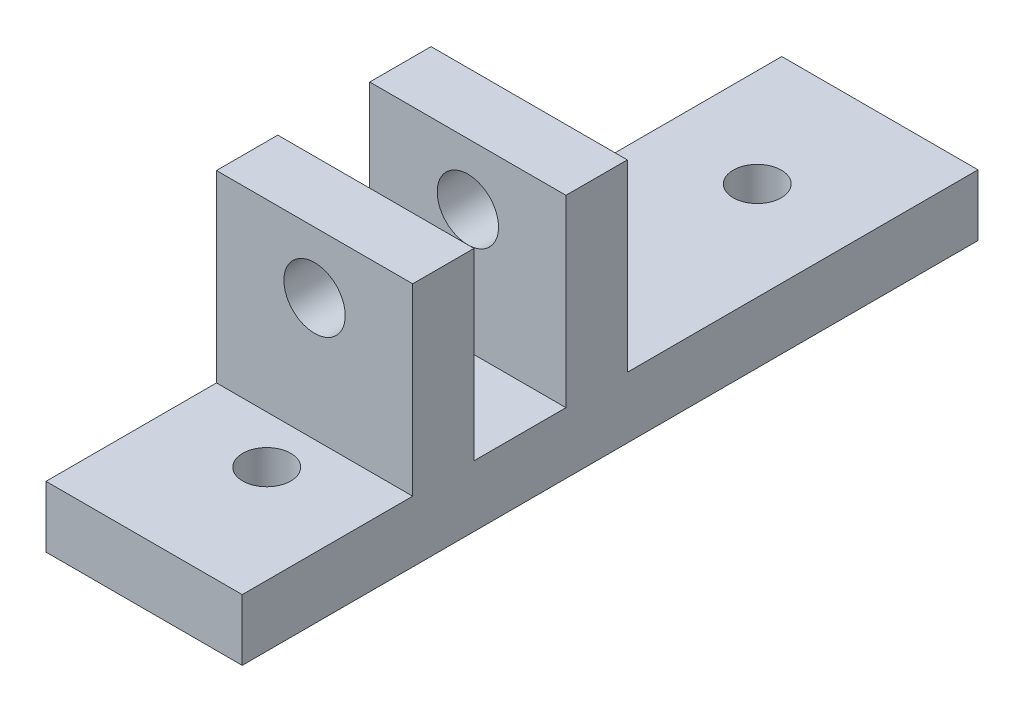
ISO-10303-21;
HEADER;
FILE_DESCRIPTION(('STEP AP214'),'2;1');
FILE_NAME('part.step','',(''),(''),'','','');
FILE_SCHEMA(('AUTOMOTIVE_DESIGN { 1 0 10303 214 1 1 1 1 }'));
ENDSEC;
DATA;
#1=APPLICATION_CONTEXT('core data for automotive mechanical design processes');
#2=APPLICATION_PROTOCOL_DEFINITION('international standard','automotive_design',2000,#1);
#3=PRODUCT_CONTEXT('',#1,'mechanical');
#4=PRODUCT('Part','Part','',(#3));
#5=PRODUCT_RELATED_PRODUCT_CATEGORY('part','',(#4));
#6=PRODUCT_DEFINITION_FORMATION('','',#4);
#7=PRODUCT_DEFINITION_CONTEXT('part definition',#1,'design');
#8=PRODUCT_DEFINITION('design','',#6,#7);
#9=PRODUCT_DEFINITION_SHAPE('','',#8);
#10=(LENGTH_UNIT() NAMED_UNIT(*) SI_UNIT(.MILLI.,.METRE.));
#11=(NAMED_UNIT(*) PLANE_ANGLE_UNIT() SI_UNIT($,.RADIAN.));
#12=(NAMED_UNIT(*) SI_UNIT($,.STERADIAN.) SOLID_ANGLE_UNIT());
#13=UNCERTAINTY_MEASURE_WITH_UNIT(LENGTH_MEASURE(1.E-05),#10,'distance_accuracy_value','');
#14=(GEOMETRIC_REPRESENTATION_CONTEXT(3) GLOBAL_UNCERTAINTY_ASSIGNED_CONTEXT((#13)) GLOBAL_UNIT_ASSIGNED_CONTEXT((#10,
#11,#12)) REPRESENTATION_CONTEXT('',''));
#15=CARTESIAN_POINT('',(0.,0.,0.));
#16=DIRECTION('',(0.,0.,1.));
#17=DIRECTION('',(1.,0.,0.));
#18=AXIS2_PLACEMENT_3D('',#15,#16,#17);
#19=CARTESIAN_POINT('',(0.,0.,76.2));
#20=DIRECTION('',(0.,0.,-1.));
#21=DIRECTION('',(-1.,0.,0.));
#22=AXIS2_PLACEMENT_3D('',#19,#20,#21);
#23=PLANE('',#22);
#24=DIRECTION('',(1.,0.,0.));
#25=VECTOR('',#24,1.);
#26=CARTESIAN_POINT('',(0.,6.35,76.2));
#27=LINE('',#26,#25);
#28=CARTESIAN_POINT('',(0.,6.35,76.2));
#29=VERTEX_POINT('',#28);
#30=CARTESIAN_POINT('',(20.32,6.35,76.2));
#31=VERTEX_POINT('',#30);
#32=EDGE_CURVE('E124',#29,#31,#27,.T.);
#33=ORIENTED_EDGE('',*,*,#32,.F.);
#34=DIRECTION('',(0.,-1.,0.));
#35=VECTOR('',#34,1.);
#36=CARTESIAN_POINT('',(0.,0.,76.2));
#37=LINE('',#36,#35);
#38=CARTESIAN_POINT('',(0.,0.,76.2));
#39=VERTEX_POINT('',#38);
#40=EDGE_CURVE('E149',#29,#39,#37,.T.);
#41=ORIENTED_EDGE('',*,*,#40,.T.);
#42=DIRECTION('',(1.,0.,0.));
#43=VECTOR('',#42,1.);
#44=CARTESIAN_POINT('',(0.,0.,76.2));
#45=LINE('',#44,#43);
#46=CARTESIAN_POINT('',(20.32,0.,76.2));
#47=VERTEX_POINT('',#46);
#48=EDGE_CURVE('E144',#39,#47,#45,.T.);
#49=ORIENTED_EDGE('',*,*,#48,.T.);
#50=DIRECTION('',(0.,1.,0.));
#51=VECTOR('',#50,1.);
#52=CARTESIAN_POINT('',(20.32,0.,76.2));
#53=LINE('',#52,#51);
#54=EDGE_CURVE('E139',#47,#31,#53,.T.);
#55=ORIENTED_EDGE('',*,*,#54,.T.);
#56=EDGE_LOOP('',(#33,#41,#49,#55));
#57=FACE_BOUND('',#56,.T.);
#58=ADVANCED_FACE('F33',(#57),#23,.F.);
#59=CARTESIAN_POINT('',(0.,25.4,76.2));
#60=DIRECTION('',(0.,-1.,0.));
#61=DIRECTION('',(0.,0.,-1.));
#62=AXIS2_PLACEMENT_3D('',#59,#60,#61);
#63=PLANE('',#62);
#64=DIRECTION('',(0.,0.,-1.));
#65=VECTOR('',#64,1.);
#66=CARTESIAN_POINT('',(0.,25.4,76.2));
#67=LINE('',#66,#65);
#68=CARTESIAN_POINT('',(0.,25.4,42.672));
#69=VERTEX_POINT('',#68);
#70=CARTESIAN_POINT('',(0.,25.4,36.322));
#71=VERTEX_POINT('',#70);
#72=EDGE_CURVE('E146',#69,#71,#67,.T.);
#73=ORIENTED_EDGE('',*,*,#72,.F.);
#74=DIRECTION('',(-1.,0.,0.));
#75=VECTOR('',#74,1.);
#76=CARTESIAN_POINT('',(0.,25.4,42.672));
#77=LINE('',#76,#75);
#78=CARTESIAN_POINT('',(20.32,25.4,42.672));
#79=VERTEX_POINT('',#78);
#80=EDGE_CURVE('E204',#79,#69,#77,.T.);
#81=ORIENTED_EDGE('',*,*,#80,.F.);
#82=DIRECTION('',(0.,0.,-1.));
#83=VECTOR('',#82,1.);
#84=CARTESIAN_POINT('',(20.32,25.4,76.2));
#85=LINE('',#84,#83);
#86=CARTESIAN_POINT('',(20.32,25.4,36.322));
#87=VERTEX_POINT('',#86);
#88=EDGE_CURVE('E161',#79,#87,#85,.T.);
#89=ORIENTED_EDGE('',*,*,#88,.T.);
#90=DIRECTION('',(1.,0.,0.));
#91=VECTOR('',#90,1.);
#92=CARTESIAN_POINT('',(0.,25.4,36.322));
#93=LINE('',#92,#91);
#94=EDGE_CURVE('E219',#71,#87,#93,.T.);
#95=ORIENTED_EDGE('',*,*,#94,.F.);
#96=EDGE_LOOP('',(#73,#81,#89,#95));
#97=FACE_BOUND('',#96,.T.);
#98=ADVANCED_FACE('F261',(#97),#63,.F.);
#99=CARTESIAN_POINT('',(0.,0.,0.));
#100=DIRECTION('',(0.,0.,-1.));
#101=DIRECTION('',(-1.,0.,0.));
#102=AXIS2_PLACEMENT_3D('',#99,#100,#101);
#103=PLANE('',#102);
#104=DIRECTION('',(0.,-1.,0.));
#105=VECTOR('',#104,1.);
#106=CARTESIAN_POINT('',(0.,0.,0.));
#107=LINE('',#106,#105);
#108=CARTESIAN_POINT('',(0.,6.35,0.));
#109=VERTEX_POINT('',#108);
#110=CARTESIAN_POINT('',(0.,0.,0.));
#111=VERTEX_POINT('',#110);
#112=EDGE_CURVE('E153',#109,#111,#107,.T.);
#113=ORIENTED_EDGE('',*,*,#112,.F.);
#114=DIRECTION('',(1.,0.,0.));
#115=VECTOR('',#114,1.);
#116=CARTESIAN_POINT('',(0.,6.35,0.));
#117=LINE('',#116,#115);
#118=CARTESIAN_POINT('',(20.32,6.35,0.));
#119=VERTEX_POINT('',#118);
#120=EDGE_CURVE('E11',#109,#119,#117,.T.);
#121=ORIENTED_EDGE('',*,*,#120,.T.);
#122=DIRECTION('',(0.,1.,0.));
#123=VECTOR('',#122,1.);
#124=CARTESIAN_POINT('',(20.32,0.,0.));
#125=LINE('',#124,#123);
#126=CARTESIAN_POINT('',(20.32,0.,0.));
#127=VERTEX_POINT('',#126);
#128=EDGE_CURVE('E158',#127,#119,#125,.T.);
#129=ORIENTED_EDGE('',*,*,#128,.F.);
#130=DIRECTION('',(1.,0.,0.));
#131=VECTOR('',#130,1.);
#132=CARTESIAN_POINT('',(0.,0.,0.));
#133=LINE('',#132,#131);
#134=EDGE_CURVE('E155',#111,#127,#133,.T.);
#135=ORIENTED_EDGE('',*,*,#134,.F.);
#136=EDGE_LOOP('',(#113,#121,#129,#135));
#137=FACE_BOUND('',#136,.T.);
#138=ADVANCED_FACE('F248',(#137),#103,.T.);
#139=CARTESIAN_POINT('',(0.,0.,76.2));
#140=DIRECTION('',(1.,0.,0.));
#141=DIRECTION('',(0.,0.,-1.));
#142=AXIS2_PLACEMENT_3D('',#139,#140,#141);
#143=PLANE('',#142);
#144=DIRECTION('',(0.,0.,1.));
#145=VECTOR('',#144,1.);
#146=CARTESIAN_POINT('',(0.,6.35,58.547));
#147=LINE('',#146,#145);
#148=CARTESIAN_POINT('',(0.,6.35,58.547));
#149=VERTEX_POINT('',#148);
#150=EDGE_CURVE('E50',#149,#29,#147,.T.);
#151=ORIENTED_EDGE('',*,*,#150,.F.);
#152=DIRECTION('',(0.,1.,0.));
#153=VECTOR('',#152,1.);
#154=CARTESIAN_POINT('',(0.,6.35,58.547));
#155=LINE('',#154,#153);
#156=CARTESIAN_POINT('',(0.,25.4,58.547));
#157=VERTEX_POINT('',#156);
#158=EDGE_CURVE('E196',#149,#157,#155,.T.);
#159=ORIENTED_EDGE('',*,*,#158,.T.);
#160=CARTESIAN_POINT('',(0.,25.4,52.197));
#161=VERTEX_POINT('',#160);
#162=EDGE_CURVE('E58',#157,#161,#67,.T.);
#163=ORIENTED_EDGE('',*,*,#162,.T.);
#164=DIRECTION('',(0.,1.,0.));
#165=VECTOR('',#164,1.);
#166=CARTESIAN_POINT('',(0.,6.35,52.197));
#167=LINE('',#166,#165);
#168=CARTESIAN_POINT('',(0.,6.35,52.197));
#169=VERTEX_POINT('',#168);
#170=EDGE_CURVE('E212',#169,#161,#167,.T.);
#171=ORIENTED_EDGE('',*,*,#170,.F.);
#172=DIRECTION('',(0.,0.,1.));
#173=VECTOR('',#172,1.);
#174=CARTESIAN_POINT('',(0.,6.35,42.672));
#175=LINE('',#174,#173);
#176=CARTESIAN_POINT('',(0.,6.35,42.672));
#177=VERTEX_POINT('',#176);
#178=EDGE_CURVE('E200',#177,#169,#175,.T.);
#179=ORIENTED_EDGE('',*,*,#178,.F.);
#180=DIRECTION('',(0.,1.,0.));
#181=VECTOR('',#180,1.);
#182=CARTESIAN_POINT('',(0.,6.35,42.672));
#183=LINE('',#182,#181);
#184=EDGE_CURVE('E216',#177,#69,#183,.T.);
#185=ORIENTED_EDGE('',*,*,#184,.T.);
#186=ORIENTED_EDGE('',*,*,#72,.T.);
#187=DIRECTION('',(0.,1.,0.));
#188=VECTOR('',#187,1.);
#189=CARTESIAN_POINT('',(0.,6.35,36.322));
#190=LINE('',#189,#188);
#191=CARTESIAN_POINT('',(0.,6.35,36.322));
#192=VERTEX_POINT('',#191);
#193=EDGE_CURVE('E233',#192,#71,#190,.T.);
#194=ORIENTED_EDGE('',*,*,#193,.F.);
#195=DIRECTION('',(0.,0.,1.));
#196=VECTOR('',#195,1.);
#197=CARTESIAN_POINT('',(0.,6.35,-50.8));
#198=LINE('',#197,#196);
#199=EDGE_CURVE('E226',#109,#192,#198,.T.);
#200=ORIENTED_EDGE('',*,*,#199,.F.);
#201=ORIENTED_EDGE('',*,*,#112,.T.);
#202=DIRECTION('',(0.,0.,-1.));
#203=VECTOR('',#202,1.);
#204=CARTESIAN_POINT('',(0.,0.,76.2));
#205=LINE('',#204,#203);
#206=EDGE_CURVE('E42',#39,#111,#205,.T.);
#207=ORIENTED_EDGE('',*,*,#206,.F.);
#208=ORIENTED_EDGE('',*,*,#40,.F.);
#209=EDGE_LOOP('',(#151,#159,#163,#171,#179,#185,#186,#194,#200,#201,#207,#208));
#210=FACE_BOUND('',#209,.T.);
#211=ADVANCED_FACE('F35',(#210),#143,.F.);
#212=CARTESIAN_POINT('',(0.,0.,76.2));
#213=DIRECTION('',(0.,1.,0.));
#214=DIRECTION('',(0.,0.,1.));
#215=AXIS2_PLACEMENT_3D('',#212,#213,#214);
#216=PLANE('',#215);
#217=CARTESIAN_POINT('',(10.16,0.,12.7));
#218=DIRECTION('',(0.,-1.,0.));
#219=DIRECTION('',(0.,0.,-1.));
#220=AXIS2_PLACEMENT_3D('',#217,#218,#219);
#221=CIRCLE('',#220,2.4892);
#222=CARTESIAN_POINT('',(10.16,0.,10.2108));
#223=VERTEX_POINT('',#222);
#224=EDGE_CURVE('E181',#223,#223,#221,.T.);
#225=ORIENTED_EDGE('',*,*,#224,.F.);
#226=EDGE_LOOP('',(#225));
#227=FACE_BOUND('',#226,.T.);
#228=CARTESIAN_POINT('',(10.16,0.,63.5));
#229=DIRECTION('',(0.,-1.,0.));
#230=DIRECTION('',(0.,0.,-1.));
#231=AXIS2_PLACEMENT_3D('',#228,#229,#230);
#232=CIRCLE('',#231,2.4892);
#233=CARTESIAN_POINT('',(10.16,0.,61.0108));
#234=VERTEX_POINT('',#233);
#235=EDGE_CURVE('E170',#234,#234,#232,.T.);
#236=ORIENTED_EDGE('',*,*,#235,.F.);
#237=EDGE_LOOP('',(#236));
#238=FACE_BOUND('',#237,.T.);
#239=ORIENTED_EDGE('',*,*,#134,.T.);
#240=DIRECTION('',(0.,0.,-1.));
#241=VECTOR('',#240,1.);
#242=CARTESIAN_POINT('',(20.32,0.,76.2));
#243=LINE('',#242,#241);
#244=EDGE_CURVE('E164',#47,#127,#243,.T.);
#245=ORIENTED_EDGE('',*,*,#244,.F.);
#246=ORIENTED_EDGE('',*,*,#48,.F.);
#247=ORIENTED_EDGE('',*,*,#206,.T.);
#248=EDGE_LOOP('',(#239,#245,#246,#247));
#249=FACE_BOUND('',#248,.T.);
#250=ADVANCED_FACE('F241',(#227,#238,#249),#216,.F.);
#251=CARTESIAN_POINT('',(20.32,0.,76.2));
#252=DIRECTION('',(-1.,0.,0.));
#253=DIRECTION('',(0.,0.,1.));
#254=AXIS2_PLACEMENT_3D('',#251,#252,#253);
#255=PLANE('',#254);
#256=CARTESIAN_POINT('',(20.32,25.4,58.547));
#257=VERTEX_POINT('',#256);
#258=CARTESIAN_POINT('',(20.32,25.4,52.197));
#259=VERTEX_POINT('',#258);
#260=EDGE_CURVE('E162',#257,#259,#85,.T.);
#261=ORIENTED_EDGE('',*,*,#260,.F.);
#262=DIRECTION('',(0.,1.,0.));
#263=VECTOR('',#262,1.);
#264=CARTESIAN_POINT('',(20.32,6.35,58.547));
#265=LINE('',#264,#263);
#266=CARTESIAN_POINT('',(20.32,6.35,58.547));
#267=VERTEX_POINT('',#266);
#268=EDGE_CURVE('E140',#267,#257,#265,.T.);
#269=ORIENTED_EDGE('',*,*,#268,.F.);
#270=DIRECTION('',(0.,0.,-1.));
#271=VECTOR('',#270,1.);
#272=CARTESIAN_POINT('',(20.32,6.35,58.547));
#273=LINE('',#272,#271);
#274=EDGE_CURVE('E127',#31,#267,#273,.T.);
#275=ORIENTED_EDGE('',*,*,#274,.F.);
#276=ORIENTED_EDGE('',*,*,#54,.F.);
#277=ORIENTED_EDGE('',*,*,#244,.T.);
#278=ORIENTED_EDGE('',*,*,#128,.T.);
#279=DIRECTION('',(0.,0.,-1.));
#280=VECTOR('',#279,1.);
#281=CARTESIAN_POINT('',(20.32,6.35,-50.8));
#282=LINE('',#281,#280);
#283=CARTESIAN_POINT('',(20.32,6.35,36.322));
#284=VERTEX_POINT('',#283);
#285=EDGE_CURVE('E231',#284,#119,#282,.T.);
#286=ORIENTED_EDGE('',*,*,#285,.F.);
#287=DIRECTION('',(0.,1.,0.));
#288=VECTOR('',#287,1.);
#289=CARTESIAN_POINT('',(20.32,6.35,36.322));
#290=LINE('',#289,#288);
#291=EDGE_CURVE('E156',#284,#87,#290,.T.);
#292=ORIENTED_EDGE('',*,*,#291,.T.);
#293=ORIENTED_EDGE('',*,*,#88,.F.);
#294=DIRECTION('',(0.,1.,0.));
#295=VECTOR('',#294,1.);
#296=CARTESIAN_POINT('',(20.32,6.35,42.672));
#297=LINE('',#296,#295);
#298=CARTESIAN_POINT('',(20.32,6.35,42.672));
#299=VERTEX_POINT('',#298);
#300=EDGE_CURVE('E220',#299,#79,#297,.T.);
#301=ORIENTED_EDGE('',*,*,#300,.F.);
#302=DIRECTION('',(0.,0.,-1.));
#303=VECTOR('',#302,1.);
#304=CARTESIAN_POINT('',(20.32,6.35,42.672));
#305=LINE('',#304,#303);
#306=CARTESIAN_POINT('',(20.32,6.35,52.197));
#307=VERTEX_POINT('',#306);
#308=EDGE_CURVE('E207',#307,#299,#305,.T.);
#309=ORIENTED_EDGE('',*,*,#308,.F.);
#310=DIRECTION('',(0.,1.,0.));
#311=VECTOR('',#310,1.);
#312=CARTESIAN_POINT('',(20.32,6.35,52.197));
#313=LINE('',#312,#311);
#314=EDGE_CURVE('E222',#307,#259,#313,.T.);
#315=ORIENTED_EDGE('',*,*,#314,.T.);
#316=EDGE_LOOP('',(#261,#269,#275,#276,#277,#278,#286,#292,#293,#301,#309,#315));
#317=FACE_BOUND('',#316,.T.);
#318=ADVANCED_FACE('F137',(#317),#255,.F.);
#319=ORIENTED_EDGE('',*,*,#162,.F.);
#320=DIRECTION('',(-1.,0.,0.));
#321=VECTOR('',#320,1.);
#322=CARTESIAN_POINT('',(0.,25.4,58.547));
#323=LINE('',#322,#321);
#324=EDGE_CURVE('E192',#257,#157,#323,.T.);
#325=ORIENTED_EDGE('',*,*,#324,.F.);
#326=ORIENTED_EDGE('',*,*,#260,.T.);
#327=DIRECTION('',(1.,0.,0.));
#328=VECTOR('',#327,1.);
#329=CARTESIAN_POINT('',(0.,25.4,52.197));
#330=LINE('',#329,#328);
#331=EDGE_CURVE('E198',#161,#259,#330,.T.);
#332=ORIENTED_EDGE('',*,*,#331,.F.);
#333=EDGE_LOOP('',(#319,#325,#326,#332));
#334=FACE_BOUND('',#333,.T.);
#335=ADVANCED_FACE('F273',(#334),#63,.F.);
#336=CARTESIAN_POINT('',(0.,6.35,36.322));
#337=DIRECTION('',(0.,0.,1.));
#338=DIRECTION('',(1.,0.,0.));
#339=AXIS2_PLACEMENT_3D('',#336,#337,#338);
#340=PLANE('',#339);
#341=CARTESIAN_POINT('',(10.16,19.05,36.322));
#342=DIRECTION('',(0.,0.,1.));
#343=DIRECTION('',(1.,0.,0.));
#344=AXIS2_PLACEMENT_3D('',#341,#342,#343);
#345=CIRCLE('',#344,3.175);
#346=CARTESIAN_POINT('',(13.335,19.05,36.322));
#347=VERTEX_POINT('',#346);
#348=EDGE_CURVE('E189',#347,#347,#345,.T.);
#349=ORIENTED_EDGE('',*,*,#348,.T.);
#350=EDGE_LOOP('',(#349));
#351=FACE_BOUND('',#350,.T.);
#352=ORIENTED_EDGE('',*,*,#94,.T.);
#353=ORIENTED_EDGE('',*,*,#291,.F.);
#354=DIRECTION('',(1.,0.,0.));
#355=VECTOR('',#354,1.);
#356=CARTESIAN_POINT('',(0.,6.35,36.322));
#357=LINE('',#356,#355);
#358=EDGE_CURVE('E228',#192,#284,#357,.T.);
#359=ORIENTED_EDGE('',*,*,#358,.F.);
#360=ORIENTED_EDGE('',*,*,#193,.T.);
#361=EDGE_LOOP('',(#352,#353,#359,#360));
#362=FACE_BOUND('',#361,.T.);
#363=ADVANCED_FACE('F255',(#351,#362),#340,.F.);
#364=CARTESIAN_POINT('',(0.,6.35,0.));
#365=DIRECTION('',(0.,1.,0.));
#366=DIRECTION('',(0.,0.,1.));
#367=AXIS2_PLACEMENT_3D('',#364,#365,#366);
#368=PLANE('',#367);
#369=CARTESIAN_POINT('',(10.16,6.35,12.7));
#370=DIRECTION('',(0.,1.,0.));
#371=DIRECTION('',(0.,0.,1.));
#372=AXIS2_PLACEMENT_3D('',#369,#370,#371);
#373=CIRCLE('',#372,2.4892);
#374=CARTESIAN_POINT('',(10.16,6.35,10.2108));
#375=VERTEX_POINT('',#374);
#376=EDGE_CURVE('E37',#375,#375,#373,.T.);
#377=ORIENTED_EDGE('',*,*,#376,.F.);
#378=EDGE_LOOP('',(#377));
#379=FACE_BOUND('',#378,.T.);
#380=ORIENTED_EDGE('',*,*,#199,.T.);
#381=ORIENTED_EDGE('',*,*,#358,.T.);
#382=ORIENTED_EDGE('',*,*,#285,.T.);
#383=ORIENTED_EDGE('',*,*,#120,.F.);
#384=EDGE_LOOP('',(#380,#381,#382,#383));
#385=FACE_BOUND('',#384,.T.);
#386=ADVANCED_FACE('F252',(#379,#385),#368,.T.);
#387=CARTESIAN_POINT('',(0.,6.35,42.672));
#388=DIRECTION('',(0.,0.,-1.));
#389=DIRECTION('',(-1.,0.,0.));
#390=AXIS2_PLACEMENT_3D('',#387,#388,#389);
#391=PLANE('',#390);
#392=CARTESIAN_POINT('',(10.16,19.05,42.672));
#393=DIRECTION('',(0.,0.,-1.));
#394=DIRECTION('',(-1.,0.,0.));
#395=AXIS2_PLACEMENT_3D('',#392,#393,#394);
#396=CIRCLE('',#395,3.175);
#397=CARTESIAN_POINT('',(13.335,19.05,42.672));
#398=VERTEX_POINT('',#397);
#399=EDGE_CURVE('E186',#398,#398,#396,.T.);
#400=ORIENTED_EDGE('',*,*,#399,.T.);
#401=EDGE_LOOP('',(#400));
#402=FACE_BOUND('',#401,.T.);
#403=ORIENTED_EDGE('',*,*,#80,.T.);
#404=ORIENTED_EDGE('',*,*,#184,.F.);
#405=DIRECTION('',(-1.,0.,0.));
#406=VECTOR('',#405,1.);
#407=CARTESIAN_POINT('',(0.,6.35,42.672));
#408=LINE('',#407,#406);
#409=EDGE_CURVE('E209',#299,#177,#408,.T.);
#410=ORIENTED_EDGE('',*,*,#409,.F.);
#411=ORIENTED_EDGE('',*,*,#300,.T.);
#412=EDGE_LOOP('',(#403,#404,#410,#411));
#413=FACE_BOUND('',#412,.T.);
#414=ADVANCED_FACE('F266',(#402,#413),#391,.F.);
#415=CARTESIAN_POINT('',(0.,6.35,52.197));
#416=DIRECTION('',(0.,0.,1.));
#417=DIRECTION('',(1.,0.,0.));
#418=AXIS2_PLACEMENT_3D('',#415,#416,#417);
#419=PLANE('',#418);
#420=CARTESIAN_POINT('',(10.16,19.05,52.197));
#421=DIRECTION('',(0.,0.,1.));
#422=DIRECTION('',(1.,0.,0.));
#423=AXIS2_PLACEMENT_3D('',#420,#421,#422);
#424=CIRCLE('',#423,3.175);
#425=CARTESIAN_POINT('',(13.335,19.05,52.197));
#426=VERTEX_POINT('',#425);
#427=EDGE_CURVE('E174',#426,#426,#424,.T.);
#428=ORIENTED_EDGE('',*,*,#427,.T.);
#429=EDGE_LOOP('',(#428));
#430=FACE_BOUND('',#429,.T.);
#431=ORIENTED_EDGE('',*,*,#331,.T.);
#432=ORIENTED_EDGE('',*,*,#314,.F.);
#433=DIRECTION('',(1.,0.,0.));
#434=VECTOR('',#433,1.);
#435=CARTESIAN_POINT('',(0.,6.35,52.197));
#436=LINE('',#435,#434);
#437=EDGE_CURVE('E203',#169,#307,#436,.T.);
#438=ORIENTED_EDGE('',*,*,#437,.F.);
#439=ORIENTED_EDGE('',*,*,#170,.T.);
#440=EDGE_LOOP('',(#431,#432,#438,#439));
#441=FACE_BOUND('',#440,.T.);
#442=ADVANCED_FACE('F271',(#430,#441),#419,.F.);
#443=CARTESIAN_POINT('',(0.,6.35,0.));
#444=DIRECTION('',(0.,1.,0.));
#445=DIRECTION('',(0.,0.,1.));
#446=AXIS2_PLACEMENT_3D('',#443,#444,#445);
#447=PLANE('',#446);
#448=ORIENTED_EDGE('',*,*,#178,.T.);
#449=ORIENTED_EDGE('',*,*,#437,.T.);
#450=ORIENTED_EDGE('',*,*,#308,.T.);
#451=ORIENTED_EDGE('',*,*,#409,.T.);
#452=EDGE_LOOP('',(#448,#449,#450,#451));
#453=FACE_BOUND('',#452,.T.);
#454=ADVANCED_FACE('F268',(#453),#447,.T.);
#455=CARTESIAN_POINT('',(0.,6.35,58.547));
#456=DIRECTION('',(0.,0.,-1.));
#457=DIRECTION('',(-1.,0.,0.));
#458=AXIS2_PLACEMENT_3D('',#455,#456,#457);
#459=PLANE('',#458);
#460=CARTESIAN_POINT('',(10.16,19.05,58.547));
#461=DIRECTION('',(0.,0.,1.));
#462=DIRECTION('',(1.,0.,0.));
#463=AXIS2_PLACEMENT_3D('',#460,#461,#462);
#464=CIRCLE('',#463,3.175);
#465=CARTESIAN_POINT('',(13.335,19.05,58.547));
#466=VERTEX_POINT('',#465);
#467=EDGE_CURVE('E169',#466,#466,#464,.T.);
#468=ORIENTED_EDGE('',*,*,#467,.F.);
#469=EDGE_LOOP('',(#468));
#470=FACE_BOUND('',#469,.T.);
#471=ORIENTED_EDGE('',*,*,#324,.T.);
#472=ORIENTED_EDGE('',*,*,#158,.F.);
#473=DIRECTION('',(-1.,0.,0.));
#474=VECTOR('',#473,1.);
#475=CARTESIAN_POINT('',(0.,6.35,58.547));
#476=LINE('',#475,#474);
#477=EDGE_CURVE('E141',#267,#149,#476,.T.);
#478=ORIENTED_EDGE('',*,*,#477,.F.);
#479=ORIENTED_EDGE('',*,*,#268,.T.);
#480=EDGE_LOOP('',(#471,#472,#478,#479));
#481=FACE_BOUND('',#480,.T.);
#482=ADVANCED_FACE('F276',(#470,#481),#459,.F.);
#483=CARTESIAN_POINT('',(0.,6.35,0.));
#484=DIRECTION('',(0.,1.,0.));
#485=DIRECTION('',(0.,0.,1.));
#486=AXIS2_PLACEMENT_3D('',#483,#484,#485);
#487=PLANE('',#486);
#488=CARTESIAN_POINT('',(10.16,6.35,63.5));
#489=DIRECTION('',(0.,1.,0.));
#490=DIRECTION('',(0.,0.,1.));
#491=AXIS2_PLACEMENT_3D('',#488,#489,#490);
#492=CIRCLE('',#491,2.4892);
#493=CARTESIAN_POINT('',(10.16,6.35,61.0108));
#494=VERTEX_POINT('',#493);
#495=EDGE_CURVE('E167',#494,#494,#492,.T.);
#496=ORIENTED_EDGE('',*,*,#495,.F.);
#497=EDGE_LOOP('',(#496));
#498=FACE_BOUND('',#497,.T.);
#499=ORIENTED_EDGE('',*,*,#150,.T.);
#500=ORIENTED_EDGE('',*,*,#32,.T.);
#501=ORIENTED_EDGE('',*,*,#274,.T.);
#502=ORIENTED_EDGE('',*,*,#477,.T.);
#503=EDGE_LOOP('',(#499,#500,#501,#502));
#504=FACE_BOUND('',#503,.T.);
#505=ADVANCED_FACE('F126',(#498,#504),#487,.T.);
#506=CARTESIAN_POINT('',(10.16,19.05,0.));
#507=DIRECTION('',(0.,0.,1.));
#508=DIRECTION('',(1.,0.,0.));
#509=AXIS2_PLACEMENT_3D('',#506,#507,#508);
#510=CYLINDRICAL_SURFACE('',#509,3.175);
#511=CARTESIAN_POINT('',(13.335,19.05,58.547));
#512=CARTESIAN_POINT('',(13.335,19.05,58.4808541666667));
#513=CARTESIAN_POINT('',(13.335,19.05,58.4147083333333));
#514=CARTESIAN_POINT('',(13.335,19.05,58.2824166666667));
#515=CARTESIAN_POINT('',(13.335,19.05,58.2162708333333));
#516=CARTESIAN_POINT('',(13.335,19.05,58.0839791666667));
#517=CARTESIAN_POINT('',(13.335,19.05,58.0178333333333));
#518=CARTESIAN_POINT('',(13.335,19.05,57.8855416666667));
#519=CARTESIAN_POINT('',(13.335,19.05,57.8193958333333));
#520=CARTESIAN_POINT('',(13.335,19.05,57.6871041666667));
#521=CARTESIAN_POINT('',(13.335,19.05,57.6209583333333));
#522=CARTESIAN_POINT('',(13.335,19.05,57.4886666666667));
#523=CARTESIAN_POINT('',(13.335,19.05,57.4225208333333));
#524=CARTESIAN_POINT('',(13.335,19.05,57.2902291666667));
#525=CARTESIAN_POINT('',(13.335,19.05,57.2240833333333));
#526=CARTESIAN_POINT('',(13.335,19.05,57.0917916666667));
#527=CARTESIAN_POINT('',(13.335,19.05,57.0256458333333));
#528=CARTESIAN_POINT('',(13.335,19.05,56.8933541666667));
#529=CARTESIAN_POINT('',(13.335,19.05,56.8272083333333));
#530=CARTESIAN_POINT('',(13.335,19.05,56.6949166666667));
#531=CARTESIAN_POINT('',(13.335,19.05,56.6287708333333));
#532=CARTESIAN_POINT('',(13.335,19.05,56.4964791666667));
#533=CARTESIAN_POINT('',(13.335,19.05,56.4303333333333));
#534=CARTESIAN_POINT('',(13.335,19.05,56.2980416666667));
#535=CARTESIAN_POINT('',(13.335,19.05,56.2318958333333));
#536=CARTESIAN_POINT('',(13.335,19.05,56.0996041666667));
#537=CARTESIAN_POINT('',(13.335,19.05,56.0334583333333));
#538=CARTESIAN_POINT('',(13.335,19.05,55.9011666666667));
#539=CARTESIAN_POINT('',(13.335,19.05,55.8350208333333));
#540=CARTESIAN_POINT('',(13.335,19.05,55.7027291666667));
#541=CARTESIAN_POINT('',(13.335,19.05,55.6365833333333));
#542=CARTESIAN_POINT('',(13.335,19.05,55.5042916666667));
#543=CARTESIAN_POINT('',(13.335,19.05,55.4381458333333));
#544=CARTESIAN_POINT('',(13.335,19.05,55.3058541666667));
#545=CARTESIAN_POINT('',(13.335,19.05,55.2397083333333));
#546=CARTESIAN_POINT('',(13.335,19.05,55.1074166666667));
#547=CARTESIAN_POINT('',(13.335,19.05,55.0412708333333));
#548=CARTESIAN_POINT('',(13.335,19.05,54.9089791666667));
#549=CARTESIAN_POINT('',(13.335,19.05,54.8428333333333));
#550=CARTESIAN_POINT('',(13.335,19.05,54.7105416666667));
#551=CARTESIAN_POINT('',(13.335,19.05,54.6443958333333));
#552=CARTESIAN_POINT('',(13.335,19.05,54.5121041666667));
#553=CARTESIAN_POINT('',(13.335,19.05,54.4459583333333));
#554=CARTESIAN_POINT('',(13.335,19.05,54.3136666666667));
#555=CARTESIAN_POINT('',(13.335,19.05,54.2475208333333));
#556=CARTESIAN_POINT('',(13.335,19.05,54.1152291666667));
#557=CARTESIAN_POINT('',(13.335,19.05,54.0490833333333));
#558=CARTESIAN_POINT('',(13.335,19.05,53.9167916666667));
#559=CARTESIAN_POINT('',(13.335,19.05,53.8506458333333));
#560=CARTESIAN_POINT('',(13.335,19.05,53.7183541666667));
#561=CARTESIAN_POINT('',(13.335,19.05,53.6522083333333));
#562=CARTESIAN_POINT('',(13.335,19.05,53.5199166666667));
#563=CARTESIAN_POINT('',(13.335,19.05,53.4537708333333));
#564=CARTESIAN_POINT('',(13.335,19.05,53.3214791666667));
#565=CARTESIAN_POINT('',(13.335,19.05,53.2553333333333));
#566=CARTESIAN_POINT('',(13.335,19.05,53.1230416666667));
#567=CARTESIAN_POINT('',(13.335,19.05,53.0568958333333));
#568=CARTESIAN_POINT('',(13.335,19.05,52.9246041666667));
#569=CARTESIAN_POINT('',(13.335,19.05,52.8584583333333));
#570=CARTESIAN_POINT('',(13.335,19.05,52.7261666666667));
#571=CARTESIAN_POINT('',(13.335,19.05,52.6600208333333));
#572=CARTESIAN_POINT('',(13.335,19.05,52.5277291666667));
#573=CARTESIAN_POINT('',(13.335,19.05,52.4615833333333));
#574=CARTESIAN_POINT('',(13.335,19.05,52.3292916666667));
#575=CARTESIAN_POINT('',(13.335,19.05,52.2631458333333));
#576=CARTESIAN_POINT('',(13.335,19.05,52.197));
#577=B_SPLINE_CURVE_WITH_KNOTS('',3,(#511,#512,#513,#514,#515,#516,#517,#518,#519,#520,#521,
#522,#523,#524,#525,#526,#527,#528,#529,#530,#531,#532,#533,#534,#535,#536,#537,#538,#539,#540,
#541,#542,#543,#544,#545,#546,#547,#548,#549,#550,#551,#552,#553,#554,#555,#556,#557,#558,#559,
#560,#561,#562,#563,#564,#565,#566,#567,#568,#569,#570,#571,#572,#573,#574,#575,#576),
.UNSPECIFIED.,.F.,.F.,(4,2,2,2,2,2,2,2,2,2,2,2,2,2,2,2,2,2,2,2,2,2,2,2,2,2,2,2,2,2,2,2,4),(0.,
0.198437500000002,0.396874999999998,0.5953125,0.793749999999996,0.992187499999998,1.190625,
1.3890625,1.5875,1.7859375,1.984375,2.1828125,2.38125,2.5796875,2.778125,2.97656249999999,3.175,
3.3734375,3.571875,3.7703125,3.96874999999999,4.1671875,4.365625,4.56406249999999,4.7625,
4.9609375,5.15937499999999,5.3578125,5.55625,5.75468749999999,5.953125,6.15156249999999,
6.34999999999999),.UNSPECIFIED.);
#578=EDGE_CURVE('BSEAM284',#466,#426,#577,.T.);
#579=ORIENTED_EDGE('',*,*,#467,.T.);
#580=ORIENTED_EDGE('',*,*,#427,.F.);
#581=ORIENTED_EDGE('',*,*,#578,.T.);
#582=ORIENTED_EDGE('',*,*,#578,.F.);
#583=EDGE_LOOP('',(#579,#581,#580,#582));
#584=FACE_BOUND('',#583,.T.);
#585=ADVANCED_FACE('F284',(#584),#510,.F.);
#586=CARTESIAN_POINT('',(13.335,19.05,42.672));
#587=CARTESIAN_POINT('',(13.335,19.05,42.6058541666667));
#588=CARTESIAN_POINT('',(13.335,19.05,42.5397083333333));
#589=CARTESIAN_POINT('',(13.335,19.05,42.4074166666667));
#590=CARTESIAN_POINT('',(13.335,19.05,42.3412708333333));
#591=CARTESIAN_POINT('',(13.335,19.05,42.2089791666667));
#592=CARTESIAN_POINT('',(13.335,19.05,42.1428333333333));
#593=CARTESIAN_POINT('',(13.335,19.05,42.0105416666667));
#594=CARTESIAN_POINT('',(13.335,19.05,41.9443958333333));
#595=CARTESIAN_POINT('',(13.335,19.05,41.8121041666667));
#596=CARTESIAN_POINT('',(13.335,19.05,41.7459583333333));
#597=CARTESIAN_POINT('',(13.335,19.05,41.6136666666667));
#598=CARTESIAN_POINT('',(13.335,19.05,41.5475208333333));
#599=CARTESIAN_POINT('',(13.335,19.05,41.4152291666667));
#600=CARTESIAN_POINT('',(13.335,19.05,41.3490833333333));
#601=CARTESIAN_POINT('',(13.335,19.05,41.2167916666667));
#602=CARTESIAN_POINT('',(13.335,19.05,41.1506458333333));
#603=CARTESIAN_POINT('',(13.335,19.05,41.0183541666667));
#604=CARTESIAN_POINT('',(13.335,19.05,40.9522083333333));
#605=CARTESIAN_POINT('',(13.335,19.05,40.8199166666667));
#606=CARTESIAN_POINT('',(13.335,19.05,40.7537708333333));
#607=CARTESIAN_POINT('',(13.335,19.05,40.6214791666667));
#608=CARTESIAN_POINT('',(13.335,19.05,40.5553333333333));
#609=CARTESIAN_POINT('',(13.335,19.05,40.4230416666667));
#610=CARTESIAN_POINT('',(13.335,19.05,40.3568958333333));
#611=CARTESIAN_POINT('',(13.335,19.05,40.2246041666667));
#612=CARTESIAN_POINT('',(13.335,19.05,40.1584583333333));
#613=CARTESIAN_POINT('',(13.335,19.05,40.0261666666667));
#614=CARTESIAN_POINT('',(13.335,19.05,39.9600208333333));
#615=CARTESIAN_POINT('',(13.335,19.05,39.8277291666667));
#616=CARTESIAN_POINT('',(13.335,19.05,39.7615833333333));
#617=CARTESIAN_POINT('',(13.335,19.05,39.6292916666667));
#618=CARTESIAN_POINT('',(13.335,19.05,39.5631458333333));
#619=CARTESIAN_POINT('',(13.335,19.05,39.4308541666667));
#620=CARTESIAN_POINT('',(13.335,19.05,39.3647083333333));
#621=CARTESIAN_POINT('',(13.335,19.05,39.2324166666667));
#622=CARTESIAN_POINT('',(13.335,19.05,39.1662708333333));
#623=CARTESIAN_POINT('',(13.335,19.05,39.0339791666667));
#624=CARTESIAN_POINT('',(13.335,19.05,38.9678333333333));
#625=CARTESIAN_POINT('',(13.335,19.05,38.8355416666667));
#626=CARTESIAN_POINT('',(13.335,19.05,38.7693958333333));
#627=CARTESIAN_POINT('',(13.335,19.05,38.6371041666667));
#628=CARTESIAN_POINT('',(13.335,19.05,38.5709583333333));
#629=CARTESIAN_POINT('',(13.335,19.05,38.4386666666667));
#630=CARTESIAN_POINT('',(13.335,19.05,38.3725208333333));
#631=CARTESIAN_POINT('',(13.335,19.05,38.2402291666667));
#632=CARTESIAN_POINT('',(13.335,19.05,38.1740833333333));
#633=CARTESIAN_POINT('',(13.335,19.05,38.0417916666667));
#634=CARTESIAN_POINT('',(13.335,19.05,37.9756458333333));
#635=CARTESIAN_POINT('',(13.335,19.05,37.8433541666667));
#636=CARTESIAN_POINT('',(13.335,19.05,37.7772083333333));
#637=CARTESIAN_POINT('',(13.335,19.05,37.6449166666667));
#638=CARTESIAN_POINT('',(13.335,19.05,37.5787708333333));
#639=CARTESIAN_POINT('',(13.335,19.05,37.4464791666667));
#640=CARTESIAN_POINT('',(13.335,19.05,37.3803333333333));
#641=CARTESIAN_POINT('',(13.335,19.05,37.2480416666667));
#642=CARTESIAN_POINT('',(13.335,19.05,37.1818958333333));
#643=CARTESIAN_POINT('',(13.335,19.05,37.0496041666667));
#644=CARTESIAN_POINT('',(13.335,19.05,36.9834583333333));
#645=CARTESIAN_POINT('',(13.335,19.05,36.8511666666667));
#646=CARTESIAN_POINT('',(13.335,19.05,36.7850208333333));
#647=CARTESIAN_POINT('',(13.335,19.05,36.6527291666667));
#648=CARTESIAN_POINT('',(13.335,19.05,36.5865833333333));
#649=CARTESIAN_POINT('',(13.335,19.05,36.4542916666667));
#650=CARTESIAN_POINT('',(13.335,19.05,36.3881458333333));
#651=CARTESIAN_POINT('',(13.335,19.05,36.322));
#652=B_SPLINE_CURVE_WITH_KNOTS('',3,(#586,#587,#588,#589,#590,#591,#592,#593,#594,#595,#596,
#597,#598,#599,#600,#601,#602,#603,#604,#605,#606,#607,#608,#609,#610,#611,#612,#613,#614,#615,
#616,#617,#618,#619,#620,#621,#622,#623,#624,#625,#626,#627,#628,#629,#630,#631,#632,#633,#634,
#635,#636,#637,#638,#639,#640,#641,#642,#643,#644,#645,#646,#647,#648,#649,#650,#651),
.UNSPECIFIED.,.F.,.F.,(4,2,2,2,2,2,2,2,2,2,2,2,2,2,2,2,2,2,2,2,2,2,2,2,2,2,2,2,2,2,2,2,4),(0.,
0.198437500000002,0.396874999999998,0.5953125,0.793749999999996,0.992187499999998,1.190625,
1.3890625,1.5875,1.7859375,1.984375,2.1828125,2.38125,2.5796875,2.778125,2.97656249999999,3.175,
3.3734375,3.571875,3.7703125,3.96874999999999,4.1671875,4.365625,4.56406249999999,4.7625,
4.9609375,5.15937499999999,5.3578125,5.55625,5.75468749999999,5.953125,6.15156249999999,
6.34999999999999),.UNSPECIFIED.);
#653=EDGE_CURVE('BSEAM319',#398,#347,#652,.T.);
#654=ORIENTED_EDGE('',*,*,#399,.F.);
#655=ORIENTED_EDGE('',*,*,#348,.F.);
#656=ORIENTED_EDGE('',*,*,#653,.T.);
#657=ORIENTED_EDGE('',*,*,#653,.F.);
#658=EDGE_LOOP('',(#654,#656,#655,#657));
#659=FACE_BOUND('',#658,.T.);
#660=ADVANCED_FACE('F319',(#659),#510,.F.);
#661=CARTESIAN_POINT('',(10.16,19.05,63.5));
#662=DIRECTION('',(0.,-1.,0.));
#663=DIRECTION('',(0.,0.,-1.));
#664=AXIS2_PLACEMENT_3D('',#661,#662,#663);
#665=CYLINDRICAL_SURFACE('',#664,2.4892);
#666=CARTESIAN_POINT('',(10.16,6.35,61.0108));
#667=CARTESIAN_POINT('',(10.16,6.28385416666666,61.0108));
#668=CARTESIAN_POINT('',(10.16,6.21770833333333,61.0108));
#669=CARTESIAN_POINT('',(10.16,6.08541666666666,61.0108));
#670=CARTESIAN_POINT('',(10.16,6.01927083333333,61.0108));
#671=CARTESIAN_POINT('',(10.16,5.88697916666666,61.0108));
#672=CARTESIAN_POINT('',(10.16,5.82083333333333,61.0108));
#673=CARTESIAN_POINT('',(10.16,5.68854166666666,61.0108));
#674=CARTESIAN_POINT('',(10.16,5.62239583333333,61.0108));
#675=CARTESIAN_POINT('',(10.16,5.49010416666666,61.0108));
#676=CARTESIAN_POINT('',(10.16,5.42395833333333,61.0108));
#677=CARTESIAN_POINT('',(10.16,5.29166666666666,61.0108));
#678=CARTESIAN_POINT('',(10.16,5.22552083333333,61.0108));
#679=CARTESIAN_POINT('',(10.16,5.09322916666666,61.0108));
#680=CARTESIAN_POINT('',(10.16,5.02708333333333,61.0108));
#681=CARTESIAN_POINT('',(10.16,4.89479166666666,61.0108));
#682=CARTESIAN_POINT('',(10.16,4.82864583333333,61.0108));
#683=CARTESIAN_POINT('',(10.16,4.69635416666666,61.0108));
#684=CARTESIAN_POINT('',(10.16,4.63020833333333,61.0108));
#685=CARTESIAN_POINT('',(10.16,4.49791666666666,61.0108));
#686=CARTESIAN_POINT('',(10.16,4.43177083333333,61.0108));
#687=CARTESIAN_POINT('',(10.16,4.29947916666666,61.0108));
#688=CARTESIAN_POINT('',(10.16,4.23333333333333,61.0108));
#689=CARTESIAN_POINT('',(10.16,4.10104166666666,61.0108));
#690=CARTESIAN_POINT('',(10.16,4.03489583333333,61.0108));
#691=CARTESIAN_POINT('',(10.16,3.90260416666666,61.0108));
#692=CARTESIAN_POINT('',(10.16,3.83645833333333,61.0108));
#693=CARTESIAN_POINT('',(10.16,3.70416666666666,61.0108));
#694=CARTESIAN_POINT('',(10.16,3.63802083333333,61.0108));
#695=CARTESIAN_POINT('',(10.16,3.50572916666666,61.0108));
#696=CARTESIAN_POINT('',(10.16,3.43958333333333,61.0108));
#697=CARTESIAN_POINT('',(10.16,3.30729166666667,61.0108));
#698=CARTESIAN_POINT('',(10.16,3.24114583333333,61.0108));
#699=CARTESIAN_POINT('',(10.16,3.10885416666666,61.0108));
#700=CARTESIAN_POINT('',(10.16,3.04270833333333,61.0108));
#701=CARTESIAN_POINT('',(10.16,2.91041666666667,61.0108));
#702=CARTESIAN_POINT('',(10.16,2.84427083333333,61.0108));
#703=CARTESIAN_POINT('',(10.16,2.71197916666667,61.0108));
#704=CARTESIAN_POINT('',(10.16,2.64583333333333,61.0108));
#705=CARTESIAN_POINT('',(10.16,2.51354166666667,61.0108));
#706=CARTESIAN_POINT('',(10.16,2.44739583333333,61.0108));
#707=CARTESIAN_POINT('',(10.16,2.31510416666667,61.0108));
#708=CARTESIAN_POINT('',(10.16,2.24895833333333,61.0108));
#709=CARTESIAN_POINT('',(10.16,2.11666666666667,61.0108));
#710=CARTESIAN_POINT('',(10.16,2.05052083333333,61.0108));
#711=CARTESIAN_POINT('',(10.16,1.91822916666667,61.0108));
#712=CARTESIAN_POINT('',(10.16,1.85208333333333,61.0108));
#713=CARTESIAN_POINT('',(10.16,1.71979166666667,61.0108));
#714=CARTESIAN_POINT('',(10.16,1.65364583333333,61.0108));
#715=CARTESIAN_POINT('',(10.16,1.52135416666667,61.0108));
#716=CARTESIAN_POINT('',(10.16,1.45520833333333,61.0108));
#717=CARTESIAN_POINT('',(10.16,1.32291666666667,61.0108));
#718=CARTESIAN_POINT('',(10.16,1.25677083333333,61.0108));
#719=CARTESIAN_POINT('',(10.16,1.12447916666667,61.0108));
#720=CARTESIAN_POINT('',(10.16,1.05833333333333,61.0108));
#721=CARTESIAN_POINT('',(10.16,0.926041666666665,61.0108));
#722=CARTESIAN_POINT('',(10.16,0.859895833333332,61.0108));
#723=CARTESIAN_POINT('',(10.16,0.727604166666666,61.0108));
#724=CARTESIAN_POINT('',(10.16,0.661458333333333,61.0108));
#725=CARTESIAN_POINT('',(10.16,0.529166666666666,61.0108));
#726=CARTESIAN_POINT('',(10.16,0.463020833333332,61.0108));
#727=CARTESIAN_POINT('',(10.16,0.330729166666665,61.0108));
#728=CARTESIAN_POINT('',(10.16,0.264583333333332,61.0108));
#729=CARTESIAN_POINT('',(10.16,0.132291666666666,61.0108));
#730=CARTESIAN_POINT('',(10.16,0.066145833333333,61.0108));
#731=CARTESIAN_POINT('',(10.16,0.,61.0108));
#732=B_SPLINE_CURVE_WITH_KNOTS('',3,(#666,#667,#668,#669,#670,#671,#672,#673,#674,#675,#676,
#677,#678,#679,#680,#681,#682,#683,#684,#685,#686,#687,#688,#689,#690,#691,#692,#693,#694,#695,
#696,#697,#698,#699,#700,#701,#702,#703,#704,#705,#706,#707,#708,#709,#710,#711,#712,#713,#714,
#715,#716,#717,#718,#719,#720,#721,#722,#723,#724,#725,#726,#727,#728,#729,#730,#731),
.UNSPECIFIED.,.F.,.F.,(4,2,2,2,2,2,2,2,2,2,2,2,2,2,2,2,2,2,2,2,2,2,2,2,2,2,2,2,2,2,2,2,4),(0.,
0.198437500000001,0.396875,0.5953125,0.793749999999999,0.9921875,1.190625,1.3890625,1.5875,
1.7859375,1.984375,2.1828125,2.38125,2.5796875,2.778125,2.9765625,3.175,3.3734375,3.571875,
3.7703125,3.96874999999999,4.1671875,4.365625,4.5640625,4.7625,4.9609375,5.159375,5.3578125,
5.55625,5.7546875,5.953125,6.1515625,6.35),.UNSPECIFIED.);
#733=EDGE_CURVE('BSEAM313',#494,#234,#732,.T.);
#734=ORIENTED_EDGE('',*,*,#495,.T.);
#735=ORIENTED_EDGE('',*,*,#235,.T.);
#736=ORIENTED_EDGE('',*,*,#733,.T.);
#737=ORIENTED_EDGE('',*,*,#733,.F.);
#738=EDGE_LOOP('',(#734,#736,#735,#737));
#739=FACE_BOUND('',#738,.T.);
#740=ADVANCED_FACE('F313',(#739),#665,.F.);
#741=CARTESIAN_POINT('',(10.16,19.05,12.7));
#742=DIRECTION('',(0.,-1.,0.));
#743=DIRECTION('',(0.,0.,-1.));
#744=AXIS2_PLACEMENT_3D('',#741,#742,#743);
#745=CYLINDRICAL_SURFACE('',#744,2.4892);
#746=CARTESIAN_POINT('',(10.16,6.35,10.2108));
#747=CARTESIAN_POINT('',(10.16,6.28385416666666,10.2108));
#748=CARTESIAN_POINT('',(10.16,6.21770833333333,10.2108));
#749=CARTESIAN_POINT('',(10.16,6.08541666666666,10.2108));
#750=CARTESIAN_POINT('',(10.16,6.01927083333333,10.2108));
#751=CARTESIAN_POINT('',(10.16,5.88697916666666,10.2108));
#752=CARTESIAN_POINT('',(10.16,5.82083333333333,10.2108));
#753=CARTESIAN_POINT('',(10.16,5.68854166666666,10.2108));
#754=CARTESIAN_POINT('',(10.16,5.62239583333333,10.2108));
#755=CARTESIAN_POINT('',(10.16,5.49010416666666,10.2108));
#756=CARTESIAN_POINT('',(10.16,5.42395833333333,10.2108));
#757=CARTESIAN_POINT('',(10.16,5.29166666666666,10.2108));
#758=CARTESIAN_POINT('',(10.16,5.22552083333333,10.2108));
#759=CARTESIAN_POINT('',(10.16,5.09322916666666,10.2108));
#760=CARTESIAN_POINT('',(10.16,5.02708333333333,10.2108));
#761=CARTESIAN_POINT('',(10.16,4.89479166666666,10.2108));
#762=CARTESIAN_POINT('',(10.16,4.82864583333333,10.2108));
#763=CARTESIAN_POINT('',(10.16,4.69635416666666,10.2108));
#764=CARTESIAN_POINT('',(10.16,4.63020833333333,10.2108));
#765=CARTESIAN_POINT('',(10.16,4.49791666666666,10.2108));
#766=CARTESIAN_POINT('',(10.16,4.43177083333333,10.2108));
#767=CARTESIAN_POINT('',(10.16,4.29947916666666,10.2108));
#768=CARTESIAN_POINT('',(10.16,4.23333333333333,10.2108));
#769=CARTESIAN_POINT('',(10.16,4.10104166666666,10.2108));
#770=CARTESIAN_POINT('',(10.16,4.03489583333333,10.2108));
#771=CARTESIAN_POINT('',(10.16,3.90260416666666,10.2108));
#772=CARTESIAN_POINT('',(10.16,3.83645833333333,10.2108));
#773=CARTESIAN_POINT('',(10.16,3.70416666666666,10.2108));
#774=CARTESIAN_POINT('',(10.16,3.63802083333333,10.2108));
#775=CARTESIAN_POINT('',(10.16,3.50572916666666,10.2108));
#776=CARTESIAN_POINT('',(10.16,3.43958333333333,10.2108));
#777=CARTESIAN_POINT('',(10.16,3.30729166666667,10.2108));
#778=CARTESIAN_POINT('',(10.16,3.24114583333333,10.2108));
#779=CARTESIAN_POINT('',(10.16,3.10885416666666,10.2108));
#780=CARTESIAN_POINT('',(10.16,3.04270833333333,10.2108));
#781=CARTESIAN_POINT('',(10.16,2.91041666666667,10.2108));
#782=CARTESIAN_POINT('',(10.16,2.84427083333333,10.2108));
#783=CARTESIAN_POINT('',(10.16,2.71197916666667,10.2108));
#784=CARTESIAN_POINT('',(10.16,2.64583333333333,10.2108));
#785=CARTESIAN_POINT('',(10.16,2.51354166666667,10.2108));
#786=CARTESIAN_POINT('',(10.16,2.44739583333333,10.2108));
#787=CARTESIAN_POINT('',(10.16,2.31510416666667,10.2108));
#788=CARTESIAN_POINT('',(10.16,2.24895833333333,10.2108));
#789=CARTESIAN_POINT('',(10.16,2.11666666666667,10.2108));
#790=CARTESIAN_POINT('',(10.16,2.05052083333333,10.2108));
#791=CARTESIAN_POINT('',(10.16,1.91822916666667,10.2108));
#792=CARTESIAN_POINT('',(10.16,1.85208333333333,10.2108));
#793=CARTESIAN_POINT('',(10.16,1.71979166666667,10.2108));
#794=CARTESIAN_POINT('',(10.16,1.65364583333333,10.2108));
#795=CARTESIAN_POINT('',(10.16,1.52135416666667,10.2108));
#796=CARTESIAN_POINT('',(10.16,1.45520833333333,10.2108));
#797=CARTESIAN_POINT('',(10.16,1.32291666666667,10.2108));
#798=CARTESIAN_POINT('',(10.16,1.25677083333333,10.2108));
#799=CARTESIAN_POINT('',(10.16,1.12447916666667,10.2108));
#800=CARTESIAN_POINT('',(10.16,1.05833333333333,10.2108));
#801=CARTESIAN_POINT('',(10.16,0.926041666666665,10.2108));
#802=CARTESIAN_POINT('',(10.16,0.859895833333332,10.2108));
#803=CARTESIAN_POINT('',(10.16,0.727604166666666,10.2108));
#804=CARTESIAN_POINT('',(10.16,0.661458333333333,10.2108));
#805=CARTESIAN_POINT('',(10.16,0.529166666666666,10.2108));
#806=CARTESIAN_POINT('',(10.16,0.463020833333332,10.2108));
#807=CARTESIAN_POINT('',(10.16,0.330729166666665,10.2108));
#808=CARTESIAN_POINT('',(10.16,0.264583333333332,10.2108));
#809=CARTESIAN_POINT('',(10.16,0.132291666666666,10.2108));
#810=CARTESIAN_POINT('',(10.16,0.066145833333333,10.2108));
#811=CARTESIAN_POINT('',(10.16,0.,10.2108));
#812=B_SPLINE_CURVE_WITH_KNOTS('',3,(#746,#747,#748,#749,#750,#751,#752,#753,#754,#755,#756,
#757,#758,#759,#760,#761,#762,#763,#764,#765,#766,#767,#768,#769,#770,#771,#772,#773,#774,#775,
#776,#777,#778,#779,#780,#781,#782,#783,#784,#785,#786,#787,#788,#789,#790,#791,#792,#793,#794,
#795,#796,#797,#798,#799,#800,#801,#802,#803,#804,#805,#806,#807,#808,#809,#810,#811),
.UNSPECIFIED.,.F.,.F.,(4,2,2,2,2,2,2,2,2,2,2,2,2,2,2,2,2,2,2,2,2,2,2,2,2,2,2,2,2,2,2,2,4),(0.,
0.198437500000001,0.396875,0.5953125,0.793749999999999,0.9921875,1.190625,1.3890625,1.5875,
1.7859375,1.984375,2.1828125,2.38125,2.5796875,2.778125,2.9765625,3.175,3.3734375,3.571875,
3.7703125,3.96874999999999,4.1671875,4.365625,4.5640625,4.7625,4.9609375,5.159375,5.3578125,
5.55625,5.7546875,5.953125,6.1515625,6.35),.UNSPECIFIED.);
#813=EDGE_CURVE('BSEAM311',#375,#223,#812,.T.);
#814=ORIENTED_EDGE('',*,*,#376,.T.);
#815=ORIENTED_EDGE('',*,*,#224,.T.);
#816=ORIENTED_EDGE('',*,*,#813,.T.);
#817=ORIENTED_EDGE('',*,*,#813,.F.);
#818=EDGE_LOOP('',(#814,#816,#815,#817));
#819=FACE_BOUND('',#818,.T.);
#820=ADVANCED_FACE('F311',(#819),#745,.F.);
#821=CLOSED_SHELL('',(#58,#98,#138,#211,#250,#318,#335,#363,#386,#414,#442,#454,#482,#505,#585,
#660,#740,#820));
#822=MANIFOLD_SOLID_BREP('B2',#821);
#823=ADVANCED_BREP_SHAPE_REPRESENTATION('',(#18,#822),#14);
#824=SHAPE_DEFINITION_REPRESENTATION(#9,#823);
ENDSEC;
END-ISO-10303-21;
